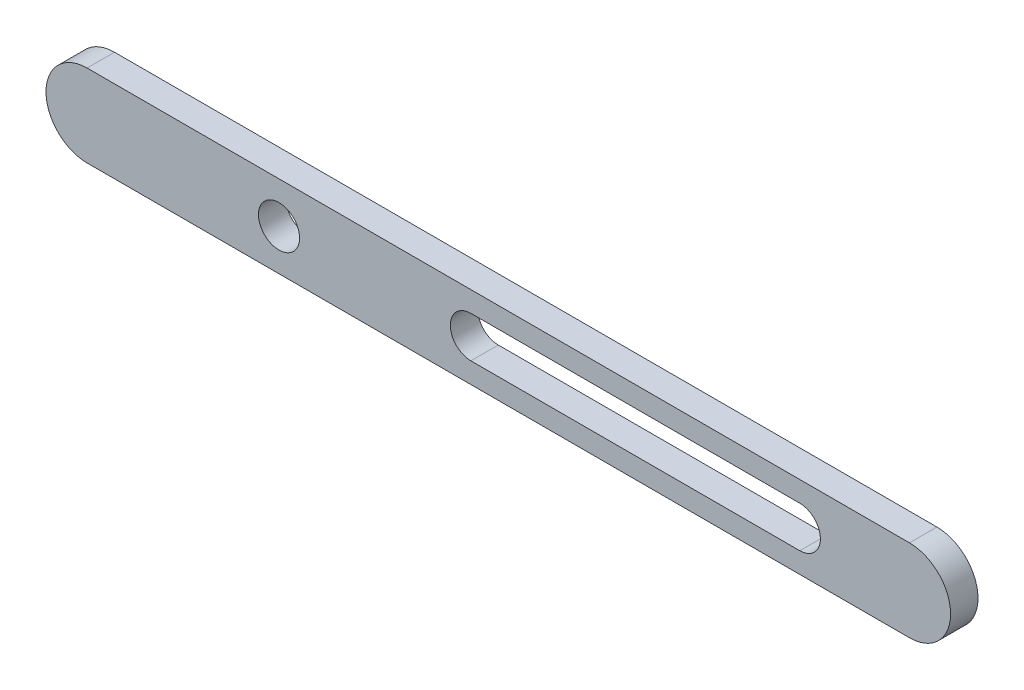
ISO-10303-21;
HEADER;
FILE_DESCRIPTION(('STEP AP214'),'2;1');
FILE_NAME('part.step','',(''),(''),'','','');
FILE_SCHEMA(('AUTOMOTIVE_DESIGN { 1 0 10303 214 1 1 1 1 }'));
ENDSEC;
DATA;
#1=APPLICATION_CONTEXT('core data for automotive mechanical design processes');
#2=APPLICATION_PROTOCOL_DEFINITION('international standard','automotive_design',2000,#1);
#3=PRODUCT_CONTEXT('',#1,'mechanical');
#4=PRODUCT('Part','Part','',(#3));
#5=PRODUCT_RELATED_PRODUCT_CATEGORY('part','',(#4));
#6=PRODUCT_DEFINITION_FORMATION('','',#4);
#7=PRODUCT_DEFINITION_CONTEXT('part definition',#1,'design');
#8=PRODUCT_DEFINITION('design','',#6,#7);
#9=PRODUCT_DEFINITION_SHAPE('','',#8);
#10=(LENGTH_UNIT() NAMED_UNIT(*) SI_UNIT(.MILLI.,.METRE.));
#11=(NAMED_UNIT(*) PLANE_ANGLE_UNIT() SI_UNIT($,.RADIAN.));
#12=(NAMED_UNIT(*) SI_UNIT($,.STERADIAN.) SOLID_ANGLE_UNIT());
#13=UNCERTAINTY_MEASURE_WITH_UNIT(LENGTH_MEASURE(1.E-05),#10,'distance_accuracy_value','');
#14=(GEOMETRIC_REPRESENTATION_CONTEXT(3) GLOBAL_UNCERTAINTY_ASSIGNED_CONTEXT((#13)) GLOBAL_UNIT_ASSIGNED_CONTEXT((#10,
#11,#12)) REPRESENTATION_CONTEXT('',''));
#15=CARTESIAN_POINT('',(0.,0.,0.));
#16=DIRECTION('',(0.,0.,1.));
#17=DIRECTION('',(1.,0.,0.));
#18=AXIS2_PLACEMENT_3D('',#15,#16,#17);
#19=CARTESIAN_POINT('',(-70.,0.,-10.));
#20=DIRECTION('',(0.,0.,1.));
#21=DIRECTION('',(1.,0.,0.));
#22=AXIS2_PLACEMENT_3D('',#19,#20,#21);
#23=CYLINDRICAL_SURFACE('',#22,15.);
#24=CARTESIAN_POINT('',(-70.,0.,0.));
#25=DIRECTION('',(0.,0.,1.));
#26=DIRECTION('',(-1.,0.,0.));
#27=AXIS2_PLACEMENT_3D('',#24,#25,#26);
#28=CIRCLE('',#27,15.);
#29=CARTESIAN_POINT('',(-70.,15.,0.));
#30=VERTEX_POINT('',#29);
#31=CARTESIAN_POINT('',(-70.,-15.,0.));
#32=VERTEX_POINT('',#31);
#33=EDGE_CURVE('E140',#30,#32,#28,.T.);
#34=ORIENTED_EDGE('',*,*,#33,.F.);
#35=DIRECTION('',(0.,0.,1.));
#36=VECTOR('',#35,1.);
#37=CARTESIAN_POINT('',(-70.,15.,-10.));
#38=LINE('',#37,#36);
#39=CARTESIAN_POINT('',(-70.,15.,-10.));
#40=VERTEX_POINT('',#39);
#41=EDGE_CURVE('E11',#40,#30,#38,.T.);
#42=ORIENTED_EDGE('',*,*,#41,.F.);
#43=CARTESIAN_POINT('',(-70.,0.,-10.));
#44=DIRECTION('',(0.,0.,1.));
#45=DIRECTION('',(-1.,0.,0.));
#46=AXIS2_PLACEMENT_3D('',#43,#44,#45);
#47=CIRCLE('',#46,15.);
#48=CARTESIAN_POINT('',(-70.,-15.,-10.));
#49=VERTEX_POINT('',#48);
#50=EDGE_CURVE('E152',#40,#49,#47,.T.);
#51=ORIENTED_EDGE('',*,*,#50,.T.);
#52=DIRECTION('',(0.,0.,1.));
#53=VECTOR('',#52,1.);
#54=CARTESIAN_POINT('',(-70.,-15.,-10.));
#55=LINE('',#54,#53);
#56=EDGE_CURVE('E36',#49,#32,#55,.T.);
#57=ORIENTED_EDGE('',*,*,#56,.T.);
#58=EDGE_LOOP('',(#34,#42,#51,#57));
#59=FACE_BOUND('',#58,.T.);
#60=ADVANCED_FACE('F33',(#59),#23,.T.);
#61=CARTESIAN_POINT('',(-70.,15.,-10.));
#62=DIRECTION('',(0.,1.,0.));
#63=DIRECTION('',(-1.,0.,0.));
#64=AXIS2_PLACEMENT_3D('',#61,#62,#63);
#65=PLANE('',#64);
#66=DIRECTION('',(-1.,0.,0.));
#67=VECTOR('',#66,1.);
#68=CARTESIAN_POINT('',(-70.,15.,0.));
#69=LINE('',#68,#67);
#70=CARTESIAN_POINT('',(230.,15.,0.));
#71=VERTEX_POINT('',#70);
#72=EDGE_CURVE('E149',#71,#30,#69,.T.);
#73=ORIENTED_EDGE('',*,*,#72,.F.);
#74=DIRECTION('',(0.,0.,1.));
#75=VECTOR('',#74,1.);
#76=CARTESIAN_POINT('',(230.,15.,-10.));
#77=LINE('',#76,#75);
#78=CARTESIAN_POINT('',(230.,15.,-10.));
#79=VERTEX_POINT('',#78);
#80=EDGE_CURVE('E41',#79,#71,#77,.T.);
#81=ORIENTED_EDGE('',*,*,#80,.F.);
#82=DIRECTION('',(-1.,0.,0.));
#83=VECTOR('',#82,1.);
#84=CARTESIAN_POINT('',(-70.,15.,-10.));
#85=LINE('',#84,#83);
#86=EDGE_CURVE('E161',#79,#40,#85,.T.);
#87=ORIENTED_EDGE('',*,*,#86,.T.);
#88=ORIENTED_EDGE('',*,*,#41,.T.);
#89=EDGE_LOOP('',(#73,#81,#87,#88));
#90=FACE_BOUND('',#89,.T.);
#91=ADVANCED_FACE('F176',(#90),#65,.T.);
#92=CARTESIAN_POINT('',(230.,0.,-10.));
#93=DIRECTION('',(0.,0.,1.));
#94=DIRECTION('',(1.,0.,0.));
#95=AXIS2_PLACEMENT_3D('',#92,#93,#94);
#96=CYLINDRICAL_SURFACE('',#95,15.);
#97=CARTESIAN_POINT('',(230.,0.,0.));
#98=DIRECTION('',(0.,0.,1.));
#99=DIRECTION('',(-1.,0.,0.));
#100=AXIS2_PLACEMENT_3D('',#97,#98,#99);
#101=CIRCLE('',#100,15.);
#102=CARTESIAN_POINT('',(230.,-15.,0.));
#103=VERTEX_POINT('',#102);
#104=EDGE_CURVE('E146',#103,#71,#101,.T.);
#105=ORIENTED_EDGE('',*,*,#104,.F.);
#106=DIRECTION('',(0.,0.,1.));
#107=VECTOR('',#106,1.);
#108=CARTESIAN_POINT('',(230.,-15.,-10.));
#109=LINE('',#108,#107);
#110=CARTESIAN_POINT('',(230.,-15.,-10.));
#111=VERTEX_POINT('',#110);
#112=EDGE_CURVE('E164',#111,#103,#109,.T.);
#113=ORIENTED_EDGE('',*,*,#112,.F.);
#114=CARTESIAN_POINT('',(230.,0.,-10.));
#115=DIRECTION('',(0.,0.,1.));
#116=DIRECTION('',(-1.,0.,0.));
#117=AXIS2_PLACEMENT_3D('',#114,#115,#116);
#118=CIRCLE('',#117,15.);
#119=EDGE_CURVE('E158',#111,#79,#118,.T.);
#120=ORIENTED_EDGE('',*,*,#119,.T.);
#121=ORIENTED_EDGE('',*,*,#80,.T.);
#122=EDGE_LOOP('',(#105,#113,#120,#121));
#123=FACE_BOUND('',#122,.T.);
#124=ADVANCED_FACE('F182',(#123),#96,.T.);
#125=CARTESIAN_POINT('',(230.,-15.,-10.));
#126=DIRECTION('',(0.,-1.,0.));
#127=DIRECTION('',(1.,0.,0.));
#128=AXIS2_PLACEMENT_3D('',#125,#126,#127);
#129=PLANE('',#128);
#130=DIRECTION('',(1.,0.,0.));
#131=VECTOR('',#130,1.);
#132=CARTESIAN_POINT('',(230.,-15.,0.));
#133=LINE('',#132,#131);
#134=EDGE_CURVE('E143',#32,#103,#133,.T.);
#135=ORIENTED_EDGE('',*,*,#134,.F.);
#136=ORIENTED_EDGE('',*,*,#56,.F.);
#137=DIRECTION('',(1.,0.,0.));
#138=VECTOR('',#137,1.);
#139=CARTESIAN_POINT('',(230.,-15.,-10.));
#140=LINE('',#139,#138);
#141=EDGE_CURVE('E155',#49,#111,#140,.T.);
#142=ORIENTED_EDGE('',*,*,#141,.T.);
#143=ORIENTED_EDGE('',*,*,#112,.T.);
#144=EDGE_LOOP('',(#135,#136,#142,#143));
#145=FACE_BOUND('',#144,.T.);
#146=ADVANCED_FACE('F172',(#145),#129,.T.);
#147=CARTESIAN_POINT('',(-70.,0.,-10.));
#148=DIRECTION('',(0.,0.,-1.));
#149=DIRECTION('',(-1.,0.,0.));
#150=AXIS2_PLACEMENT_3D('',#147,#148,#149);
#151=PLANE('',#150);
#152=CARTESIAN_POINT('',(70.,0.,-10.));
#153=DIRECTION('',(0.,0.,1.));
#154=DIRECTION('',(-1.,0.,0.));
#155=AXIS2_PLACEMENT_3D('',#152,#153,#154);
#156=CIRCLE('',#155,7.5);
#157=CARTESIAN_POINT('',(70.,7.5,-10.));
#158=VERTEX_POINT('',#157);
#159=CARTESIAN_POINT('',(70.,-7.5,-10.));
#160=VERTEX_POINT('',#159);
#161=EDGE_CURVE('E118',#158,#160,#156,.T.);
#162=ORIENTED_EDGE('',*,*,#161,.T.);
#163=DIRECTION('',(1.,0.,0.));
#164=VECTOR('',#163,1.);
#165=CARTESIAN_POINT('',(70.,-7.5,-10.));
#166=LINE('',#165,#164);
#167=CARTESIAN_POINT('',(190.,-7.5,-10.));
#168=VERTEX_POINT('',#167);
#169=EDGE_CURVE('E124',#160,#168,#166,.T.);
#170=ORIENTED_EDGE('',*,*,#169,.T.);
#171=CARTESIAN_POINT('',(190.,0.,-10.));
#172=DIRECTION('',(0.,0.,1.));
#173=DIRECTION('',(1.,0.,0.));
#174=AXIS2_PLACEMENT_3D('',#171,#172,#173);
#175=CIRCLE('',#174,7.5);
#176=CARTESIAN_POINT('',(190.,7.5,-10.));
#177=VERTEX_POINT('',#176);
#178=EDGE_CURVE('E49',#168,#177,#175,.T.);
#179=ORIENTED_EDGE('',*,*,#178,.T.);
#180=DIRECTION('',(-1.,0.,0.));
#181=VECTOR('',#180,1.);
#182=CARTESIAN_POINT('',(70.,7.5,-10.));
#183=LINE('',#182,#181);
#184=EDGE_CURVE('E127',#177,#158,#183,.T.);
#185=ORIENTED_EDGE('',*,*,#184,.T.);
#186=EDGE_LOOP('',(#162,#170,#179,#185));
#187=FACE_BOUND('',#186,.T.);
#188=CARTESIAN_POINT('',(0.,0.,-10.));
#189=DIRECTION('',(0.,0.,1.));
#190=DIRECTION('',(1.,0.,0.));
#191=AXIS2_PLACEMENT_3D('',#188,#189,#190);
#192=CIRCLE('',#191,7.5);
#193=CARTESIAN_POINT('',(7.5,0.,-10.));
#194=VERTEX_POINT('',#193);
#195=EDGE_CURVE('E137',#194,#194,#192,.T.);
#196=ORIENTED_EDGE('',*,*,#195,.T.);
#197=EDGE_LOOP('',(#196));
#198=FACE_BOUND('',#197,.T.);
#199=ORIENTED_EDGE('',*,*,#50,.F.);
#200=ORIENTED_EDGE('',*,*,#86,.F.);
#201=ORIENTED_EDGE('',*,*,#119,.F.);
#202=ORIENTED_EDGE('',*,*,#141,.F.);
#203=EDGE_LOOP('',(#199,#200,#201,#202));
#204=FACE_BOUND('',#203,.T.);
#205=ADVANCED_FACE('F179',(#187,#198,#204),#151,.T.);
#206=CARTESIAN_POINT('',(-70.,0.,0.));
#207=DIRECTION('',(0.,0.,-1.));
#208=DIRECTION('',(-1.,0.,0.));
#209=AXIS2_PLACEMENT_3D('',#206,#207,#208);
#210=PLANE('',#209);
#211=DIRECTION('',(1.,0.,0.));
#212=VECTOR('',#211,1.);
#213=CARTESIAN_POINT('',(70.,-7.5,0.));
#214=LINE('',#213,#212);
#215=CARTESIAN_POINT('',(70.,-7.5,0.));
#216=VERTEX_POINT('',#215);
#217=CARTESIAN_POINT('',(190.,-7.5,0.));
#218=VERTEX_POINT('',#217);
#219=EDGE_CURVE('E109',#216,#218,#214,.T.);
#220=ORIENTED_EDGE('',*,*,#219,.F.);
#221=CARTESIAN_POINT('',(70.,0.,0.));
#222=DIRECTION('',(0.,0.,1.));
#223=DIRECTION('',(-1.,0.,0.));
#224=AXIS2_PLACEMENT_3D('',#221,#222,#223);
#225=CIRCLE('',#224,7.5);
#226=CARTESIAN_POINT('',(70.,7.5,0.));
#227=VERTEX_POINT('',#226);
#228=EDGE_CURVE('E57',#227,#216,#225,.T.);
#229=ORIENTED_EDGE('',*,*,#228,.F.);
#230=DIRECTION('',(-1.,0.,0.));
#231=VECTOR('',#230,1.);
#232=CARTESIAN_POINT('',(70.,7.5,0.));
#233=LINE('',#232,#231);
#234=CARTESIAN_POINT('',(190.,7.5,0.));
#235=VERTEX_POINT('',#234);
#236=EDGE_CURVE('E116',#235,#227,#233,.T.);
#237=ORIENTED_EDGE('',*,*,#236,.F.);
#238=CARTESIAN_POINT('',(190.,0.,0.));
#239=DIRECTION('',(0.,0.,1.));
#240=DIRECTION('',(1.,0.,0.));
#241=AXIS2_PLACEMENT_3D('',#238,#239,#240);
#242=CIRCLE('',#241,7.5);
#243=EDGE_CURVE('E100',#218,#235,#242,.T.);
#244=ORIENTED_EDGE('',*,*,#243,.F.);
#245=EDGE_LOOP('',(#220,#229,#237,#244));
#246=FACE_BOUND('',#245,.T.);
#247=CARTESIAN_POINT('',(0.,0.,0.));
#248=DIRECTION('',(0.,0.,1.));
#249=DIRECTION('',(1.,0.,0.));
#250=AXIS2_PLACEMENT_3D('',#247,#248,#249);
#251=CIRCLE('',#250,7.5);
#252=CARTESIAN_POINT('',(7.5,0.,0.));
#253=VERTEX_POINT('',#252);
#254=EDGE_CURVE('E132',#253,#253,#251,.T.);
#255=ORIENTED_EDGE('',*,*,#254,.F.);
#256=EDGE_LOOP('',(#255));
#257=FACE_BOUND('',#256,.T.);
#258=ORIENTED_EDGE('',*,*,#33,.T.);
#259=ORIENTED_EDGE('',*,*,#134,.T.);
#260=ORIENTED_EDGE('',*,*,#104,.T.);
#261=ORIENTED_EDGE('',*,*,#72,.T.);
#262=EDGE_LOOP('',(#258,#259,#260,#261));
#263=FACE_BOUND('',#262,.T.);
#264=ADVANCED_FACE('F113',(#246,#257,#263),#210,.F.);
#265=CARTESIAN_POINT('',(0.,0.,-10.));
#266=DIRECTION('',(0.,0.,1.));
#267=DIRECTION('',(1.,0.,0.));
#268=AXIS2_PLACEMENT_3D('',#265,#266,#267);
#269=CYLINDRICAL_SURFACE('',#268,7.5);
#270=ORIENTED_EDGE('',*,*,#195,.F.);
#271=EDGE_LOOP('',(#270));
#272=FACE_BOUND('',#271,.T.);
#273=ORIENTED_EDGE('',*,*,#254,.T.);
#274=EDGE_LOOP('',(#273));
#275=FACE_BOUND('',#274,.T.);
#276=ADVANCED_FACE('F225',(#272,#275),#269,.F.);
#277=CARTESIAN_POINT('',(70.,0.,-10.));
#278=DIRECTION('',(0.,0.,1.));
#279=DIRECTION('',(1.,0.,0.));
#280=AXIS2_PLACEMENT_3D('',#277,#278,#279);
#281=CYLINDRICAL_SURFACE('',#280,7.5);
#282=ORIENTED_EDGE('',*,*,#228,.T.);
#283=DIRECTION('',(0.,0.,1.));
#284=VECTOR('',#283,1.);
#285=CARTESIAN_POINT('',(70.,-7.5,-10.));
#286=LINE('',#285,#284);
#287=EDGE_CURVE('E106',#160,#216,#286,.T.);
#288=ORIENTED_EDGE('',*,*,#287,.F.);
#289=ORIENTED_EDGE('',*,*,#161,.F.);
#290=DIRECTION('',(0.,0.,1.));
#291=VECTOR('',#290,1.);
#292=CARTESIAN_POINT('',(70.,7.5,-10.));
#293=LINE('',#292,#291);
#294=EDGE_CURVE('E130',#158,#227,#293,.T.);
#295=ORIENTED_EDGE('',*,*,#294,.T.);
#296=EDGE_LOOP('',(#282,#288,#289,#295));
#297=FACE_BOUND('',#296,.T.);
#298=ADVANCED_FACE('F234',(#297),#281,.F.);
#299=CARTESIAN_POINT('',(70.,7.5,-10.));
#300=DIRECTION('',(0.,1.,0.));
#301=DIRECTION('',(0.,0.,1.));
#302=AXIS2_PLACEMENT_3D('',#299,#300,#301);
#303=PLANE('',#302);
#304=ORIENTED_EDGE('',*,*,#236,.T.);
#305=ORIENTED_EDGE('',*,*,#294,.F.);
#306=ORIENTED_EDGE('',*,*,#184,.F.);
#307=DIRECTION('',(0.,0.,1.));
#308=VECTOR('',#307,1.);
#309=CARTESIAN_POINT('',(190.,7.5,-10.));
#310=LINE('',#309,#308);
#311=EDGE_CURVE('E105',#177,#235,#310,.T.);
#312=ORIENTED_EDGE('',*,*,#311,.T.);
#313=EDGE_LOOP('',(#304,#305,#306,#312));
#314=FACE_BOUND('',#313,.T.);
#315=ADVANCED_FACE('F244',(#314),#303,.F.);
#316=CARTESIAN_POINT('',(190.,0.,-10.));
#317=DIRECTION('',(0.,0.,1.));
#318=DIRECTION('',(1.,0.,0.));
#319=AXIS2_PLACEMENT_3D('',#316,#317,#318);
#320=CYLINDRICAL_SURFACE('',#319,7.5);
#321=ORIENTED_EDGE('',*,*,#243,.T.);
#322=ORIENTED_EDGE('',*,*,#311,.F.);
#323=ORIENTED_EDGE('',*,*,#178,.F.);
#324=DIRECTION('',(0.,0.,1.));
#325=VECTOR('',#324,1.);
#326=CARTESIAN_POINT('',(190.,-7.5,-10.));
#327=LINE('',#326,#325);
#328=EDGE_CURVE('E96',#168,#218,#327,.T.);
#329=ORIENTED_EDGE('',*,*,#328,.T.);
#330=EDGE_LOOP('',(#321,#322,#323,#329));
#331=FACE_BOUND('',#330,.T.);
#332=ADVANCED_FACE('F98',(#331),#320,.F.);
#333=CARTESIAN_POINT('',(70.,-7.5,-10.));
#334=DIRECTION('',(0.,-1.,0.));
#335=DIRECTION('',(0.,0.,-1.));
#336=AXIS2_PLACEMENT_3D('',#333,#334,#335);
#337=PLANE('',#336);
#338=ORIENTED_EDGE('',*,*,#219,.T.);
#339=ORIENTED_EDGE('',*,*,#328,.F.);
#340=ORIENTED_EDGE('',*,*,#169,.F.);
#341=ORIENTED_EDGE('',*,*,#287,.T.);
#342=EDGE_LOOP('',(#338,#339,#340,#341));
#343=FACE_BOUND('',#342,.T.);
#344=ADVANCED_FACE('F110',(#343),#337,.F.);
#345=CLOSED_SHELL('',(#60,#91,#124,#146,#205,#264,#276,#298,#315,#332,#344));
#346=MANIFOLD_SOLID_BREP('B2',#345);
#347=ADVANCED_BREP_SHAPE_REPRESENTATION('',(#18,#346),#14);
#348=SHAPE_DEFINITION_REPRESENTATION(#9,#347);
ENDSEC;
END-ISO-10303-21;
